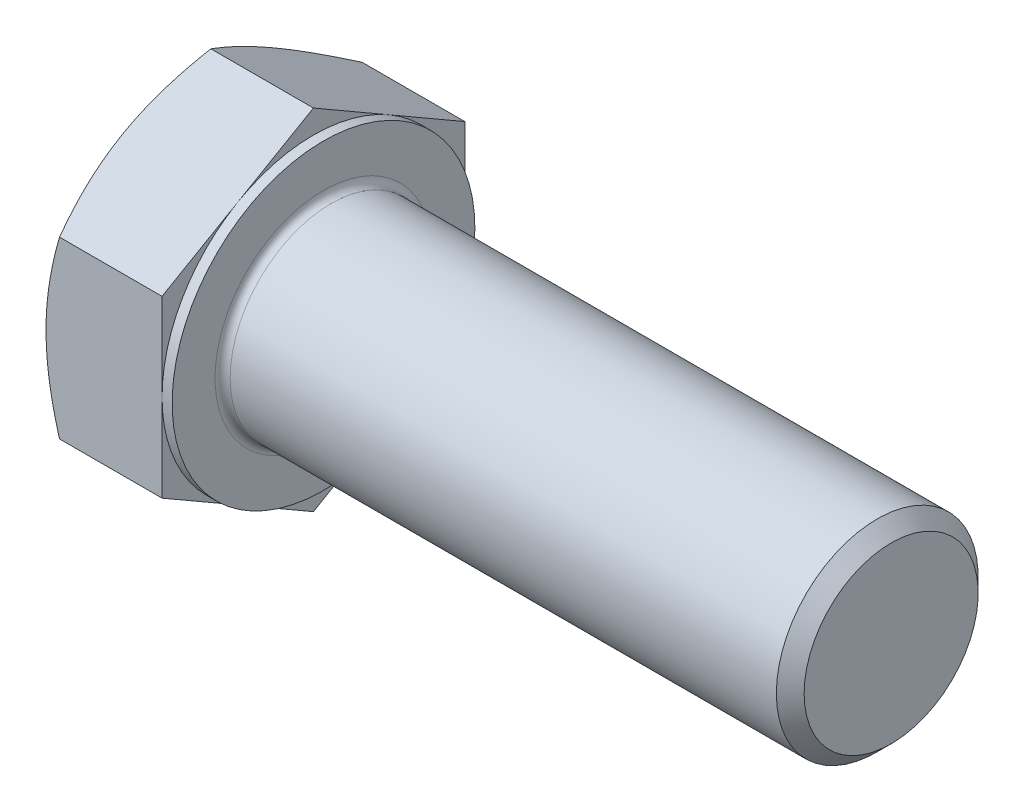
ISO-10303-21;
HEADER;
FILE_DESCRIPTION(('STEP AP214'),'2;1');
FILE_NAME('part.step','',(''),(''),'','','');
FILE_SCHEMA(('AUTOMOTIVE_DESIGN { 1 0 10303 214 1 1 1 1 }'));
ENDSEC;
DATA;
#1=APPLICATION_CONTEXT('core data for automotive mechanical design processes');
#2=APPLICATION_PROTOCOL_DEFINITION('international standard','automotive_design',2000,#1);
#3=PRODUCT_CONTEXT('',#1,'mechanical');
#4=PRODUCT('Part','Part','',(#3));
#5=PRODUCT_RELATED_PRODUCT_CATEGORY('part','',(#4));
#6=PRODUCT_DEFINITION_FORMATION('','',#4);
#7=PRODUCT_DEFINITION_CONTEXT('part definition',#1,'design');
#8=PRODUCT_DEFINITION('design','',#6,#7);
#9=PRODUCT_DEFINITION_SHAPE('','',#8);
#10=(LENGTH_UNIT() NAMED_UNIT(*) SI_UNIT(.MILLI.,.METRE.));
#11=(NAMED_UNIT(*) PLANE_ANGLE_UNIT() SI_UNIT($,.RADIAN.));
#12=(NAMED_UNIT(*) SI_UNIT($,.STERADIAN.) SOLID_ANGLE_UNIT());
#13=UNCERTAINTY_MEASURE_WITH_UNIT(LENGTH_MEASURE(1.E-05),#10,'distance_accuracy_value','');
#14=(GEOMETRIC_REPRESENTATION_CONTEXT(3) GLOBAL_UNCERTAINTY_ASSIGNED_CONTEXT((#13)) GLOBAL_UNIT_ASSIGNED_CONTEXT((#10,
#11,#12)) REPRESENTATION_CONTEXT('',''));
#15=CARTESIAN_POINT('',(0.,0.,0.));
#16=DIRECTION('',(0.,0.,1.));
#17=DIRECTION('',(1.,0.,0.));
#18=AXIS2_PLACEMENT_3D('',#15,#16,#17);
#19=CARTESIAN_POINT('',(10.,13.856406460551,0.));
#20=DIRECTION('',(1.,0.,0.));
#21=DIRECTION('',(0.,0.,-1.));
#22=AXIS2_PLACEMENT_3D('',#19,#20,#21);
#23=PLANE('',#22);
#24=CARTESIAN_POINT('',(10.,0.,0.));
#25=DIRECTION('',(1.,0.,0.));
#26=DIRECTION('',(0.,0.,-1.));
#27=AXIS2_PLACEMENT_3D('',#24,#25,#26);
#28=CIRCLE('',#27,8.6);
#29=CARTESIAN_POINT('',(10.,0.,-8.6));
#30=VERTEX_POINT('',#29);
#31=EDGE_CURVE('E38',#30,#30,#28,.F.);
#32=ORIENTED_EDGE('',*,*,#31,.T.);
#33=EDGE_LOOP('',(#32));
#34=FACE_BOUND('',#33,.T.);
#35=CARTESIAN_POINT('',(10.,0.,0.));
#36=DIRECTION('',(1.,0.,0.));
#37=DIRECTION('',(0.,0.,-1.));
#38=AXIS2_PLACEMENT_3D('',#35,#36,#37);
#39=CIRCLE('',#38,12.);
#40=CARTESIAN_POINT('',(10.,0.,-12.));
#41=VERTEX_POINT('',#40);
#42=EDGE_CURVE('E289',#41,#41,#39,.T.);
#43=ORIENTED_EDGE('',*,*,#42,.T.);
#44=EDGE_LOOP('',(#43));
#45=FACE_BOUND('',#44,.T.);
#46=ADVANCED_FACE('F30',(#34,#45),#23,.T.);
#47=CARTESIAN_POINT('',(0.,0.,0.));
#48=DIRECTION('',(-1.,0.,0.));
#49=DIRECTION('',(0.,0.,1.));
#50=AXIS2_PLACEMENT_3D('',#47,#48,#49);
#51=CYLINDRICAL_SURFACE('',#50,8.);
#52=CARTESIAN_POINT('',(10.6,0.,0.));
#53=DIRECTION('',(1.,0.,0.));
#54=DIRECTION('',(0.,0.,-1.));
#55=AXIS2_PLACEMENT_3D('',#52,#53,#54);
#56=CIRCLE('',#55,8.);
#57=CARTESIAN_POINT('',(10.6,0.,-8.));
#58=VERTEX_POINT('',#57);
#59=EDGE_CURVE('E11',#58,#58,#56,.T.);
#60=ORIENTED_EDGE('',*,*,#59,.T.);
#61=EDGE_LOOP('',(#60));
#62=FACE_BOUND('',#61,.T.);
#63=CARTESIAN_POINT('',(53.8985,0.,0.));
#64=DIRECTION('',(-1.,0.,0.));
#65=DIRECTION('',(0.,0.,1.));
#66=AXIS2_PLACEMENT_3D('',#63,#64,#65);
#67=CIRCLE('',#66,8.);
#68=CARTESIAN_POINT('',(53.8985,0.,8.));
#69=VERTEX_POINT('',#68);
#70=EDGE_CURVE('E268',#69,#69,#67,.T.);
#71=ORIENTED_EDGE('',*,*,#70,.T.);
#72=EDGE_LOOP('',(#71));
#73=FACE_BOUND('',#72,.T.);
#74=ADVANCED_FACE('F242',(#62,#73),#51,.T.);
#75=CARTESIAN_POINT('',(55.,0.,0.));
#76=DIRECTION('',(-1.,0.,0.));
#77=DIRECTION('',(0.,0.,1.));
#78=AXIS2_PLACEMENT_3D('',#75,#76,#77);
#79=CONICAL_SURFACE('',#78,6.8985,0.78539816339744);
#80=ORIENTED_EDGE('',*,*,#70,.F.);
#81=EDGE_LOOP('',(#80));
#82=FACE_BOUND('',#81,.T.);
#83=CARTESIAN_POINT('',(55.,0.,0.));
#84=DIRECTION('',(-1.,0.,0.));
#85=DIRECTION('',(0.,0.,1.));
#86=AXIS2_PLACEMENT_3D('',#83,#84,#85);
#87=CIRCLE('',#86,6.8985);
#88=CARTESIAN_POINT('',(55.,0.,6.8985));
#89=VERTEX_POINT('',#88);
#90=EDGE_CURVE('E266',#89,#89,#87,.T.);
#91=ORIENTED_EDGE('',*,*,#90,.T.);
#92=EDGE_LOOP('',(#91));
#93=FACE_BOUND('',#92,.T.);
#94=ADVANCED_FACE('F247',(#82,#93),#79,.T.);
#95=CARTESIAN_POINT('',(55.,0.,0.));
#96=DIRECTION('',(-1.,0.,0.));
#97=DIRECTION('',(0.,0.,1.));
#98=AXIS2_PLACEMENT_3D('',#95,#96,#97);
#99=PLANE('',#98);
#100=ORIENTED_EDGE('',*,*,#90,.F.);
#101=EDGE_LOOP('',(#100));
#102=FACE_BOUND('',#101,.T.);
#103=ADVANCED_FACE('F254',(#102),#99,.F.);
#104=CARTESIAN_POINT('',(9.2,12.,0.));
#105=DIRECTION('',(1.,0.,0.));
#106=DIRECTION('',(0.,0.,-1.));
#107=AXIS2_PLACEMENT_3D('',#104,#105,#106);
#108=PLANE('',#107);
#109=DIRECTION('',(0.,0.500000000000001,0.866025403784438));
#110=VECTOR('',#109,1.);
#111=CARTESIAN_POINT('',(9.2,6.9282032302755,-12.));
#112=LINE('',#111,#110);
#113=CARTESIAN_POINT('',(9.2,6.9282032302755,-12.));
#114=VERTEX_POINT('',#113);
#115=CARTESIAN_POINT('',(9.2,10.3923048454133,-6.00000000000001));
#116=VERTEX_POINT('',#115);
#117=EDGE_CURVE('E162',#114,#116,#112,.T.);
#118=ORIENTED_EDGE('',*,*,#117,.T.);
#119=CARTESIAN_POINT('',(9.2,0.,0.));
#120=DIRECTION('',(-1.,0.,0.));
#121=DIRECTION('',(0.,0.,1.));
#122=AXIS2_PLACEMENT_3D('',#119,#120,#121);
#123=CIRCLE('',#122,12.);
#124=CARTESIAN_POINT('',(9.2,0.,-12.));
#125=VERTEX_POINT('',#124);
#126=EDGE_CURVE('E45',#116,#125,#123,.T.);
#127=ORIENTED_EDGE('',*,*,#126,.T.);
#128=DIRECTION('',(0.,1.,0.));
#129=VECTOR('',#128,1.);
#130=CARTESIAN_POINT('',(9.2,6.9282032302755,-12.));
#131=LINE('',#130,#129);
#132=EDGE_CURVE('E292',#125,#114,#131,.T.);
#133=ORIENTED_EDGE('',*,*,#132,.T.);
#134=EDGE_LOOP('',(#118,#127,#133));
#135=FACE_BOUND('',#134,.T.);
#136=ADVANCED_FACE('F257',(#135),#108,.T.);
#137=CARTESIAN_POINT('',(9.2,13.856406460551,0.));
#138=VERTEX_POINT('',#137);
#139=EDGE_CURVE('E160',#116,#138,#112,.T.);
#140=ORIENTED_EDGE('',*,*,#139,.T.);
#141=DIRECTION('',(0.,-0.500000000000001,0.866025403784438));
#142=VECTOR('',#141,1.);
#143=CARTESIAN_POINT('',(9.2,13.856406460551,0.));
#144=LINE('',#143,#142);
#145=CARTESIAN_POINT('',(9.2,10.3923048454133,6.00000000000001));
#146=VERTEX_POINT('',#145);
#147=EDGE_CURVE('E159',#138,#146,#144,.T.);
#148=ORIENTED_EDGE('',*,*,#147,.T.);
#149=EDGE_CURVE('E148',#146,#116,#123,.T.);
#150=ORIENTED_EDGE('',*,*,#149,.T.);
#151=EDGE_LOOP('',(#140,#148,#150));
#152=FACE_BOUND('',#151,.T.);
#153=ADVANCED_FACE('F262',(#152),#108,.T.);
#154=CARTESIAN_POINT('',(9.2,6.9282032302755,12.));
#155=VERTEX_POINT('',#154);
#156=EDGE_CURVE('E127',#146,#155,#144,.T.);
#157=ORIENTED_EDGE('',*,*,#156,.T.);
#158=DIRECTION('',(0.,-1.,0.));
#159=VECTOR('',#158,1.);
#160=CARTESIAN_POINT('',(9.2,6.9282032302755,12.));
#161=LINE('',#160,#159);
#162=CARTESIAN_POINT('',(9.2,0.,12.));
#163=VERTEX_POINT('',#162);
#164=EDGE_CURVE('E121',#155,#163,#161,.T.);
#165=ORIENTED_EDGE('',*,*,#164,.T.);
#166=EDGE_CURVE('E125',#163,#146,#123,.T.);
#167=ORIENTED_EDGE('',*,*,#166,.T.);
#168=EDGE_LOOP('',(#157,#165,#167));
#169=FACE_BOUND('',#168,.T.);
#170=ADVANCED_FACE('F123',(#169),#108,.T.);
#171=CARTESIAN_POINT('',(9.2,-6.92820323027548,12.));
#172=VERTEX_POINT('',#171);
#173=EDGE_CURVE('E131',#163,#172,#161,.T.);
#174=ORIENTED_EDGE('',*,*,#173,.T.);
#175=DIRECTION('',(0.,-0.500000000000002,-0.866025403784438));
#176=VECTOR('',#175,1.);
#177=CARTESIAN_POINT('',(9.2,-13.856406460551,0.));
#178=LINE('',#177,#176);
#179=CARTESIAN_POINT('',(9.2,-10.3923048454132,6.00000000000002));
#180=VERTEX_POINT('',#179);
#181=EDGE_CURVE('E138',#172,#180,#178,.T.);
#182=ORIENTED_EDGE('',*,*,#181,.T.);
#183=EDGE_CURVE('E135',#180,#163,#123,.T.);
#184=ORIENTED_EDGE('',*,*,#183,.T.);
#185=EDGE_LOOP('',(#174,#182,#184));
#186=FACE_BOUND('',#185,.T.);
#187=ADVANCED_FACE('F136',(#186),#108,.T.);
#188=CARTESIAN_POINT('',(9.2,-13.856406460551,0.));
#189=VERTEX_POINT('',#188);
#190=EDGE_CURVE('E154',#180,#189,#178,.T.);
#191=ORIENTED_EDGE('',*,*,#190,.T.);
#192=DIRECTION('',(0.,0.5,-0.866025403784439));
#193=VECTOR('',#192,1.);
#194=CARTESIAN_POINT('',(9.2,-6.92820323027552,-12.));
#195=LINE('',#194,#193);
#196=CARTESIAN_POINT('',(9.2,-10.3923048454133,-6.));
#197=VERTEX_POINT('',#196);
#198=EDGE_CURVE('E330',#189,#197,#195,.T.);
#199=ORIENTED_EDGE('',*,*,#198,.T.);
#200=EDGE_CURVE('E142',#197,#180,#123,.T.);
#201=ORIENTED_EDGE('',*,*,#200,.T.);
#202=EDGE_LOOP('',(#191,#199,#201));
#203=FACE_BOUND('',#202,.T.);
#204=ADVANCED_FACE('F331',(#203),#108,.T.);
#205=CARTESIAN_POINT('',(9.2,-6.92820323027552,-12.));
#206=VERTEX_POINT('',#205);
#207=EDGE_CURVE('E149',#197,#206,#195,.T.);
#208=ORIENTED_EDGE('',*,*,#207,.T.);
#209=EDGE_CURVE('E293',#206,#125,#131,.T.);
#210=ORIENTED_EDGE('',*,*,#209,.T.);
#211=EDGE_CURVE('E300',#125,#197,#123,.T.);
#212=ORIENTED_EDGE('',*,*,#211,.T.);
#213=EDGE_LOOP('',(#208,#210,#212));
#214=FACE_BOUND('',#213,.T.);
#215=ADVANCED_FACE('F263',(#214),#108,.T.);
#216=CARTESIAN_POINT('',(0.,0.,0.));
#217=DIRECTION('',(-1.,0.,0.));
#218=DIRECTION('',(0.,0.,1.));
#219=AXIS2_PLACEMENT_3D('',#216,#217,#218);
#220=CYLINDRICAL_SURFACE('',#219,12.);
#221=ORIENTED_EDGE('',*,*,#126,.F.);
#222=ORIENTED_EDGE('',*,*,#149,.F.);
#223=ORIENTED_EDGE('',*,*,#166,.F.);
#224=ORIENTED_EDGE('',*,*,#183,.F.);
#225=ORIENTED_EDGE('',*,*,#200,.F.);
#226=ORIENTED_EDGE('',*,*,#211,.F.);
#227=EDGE_LOOP('',(#221,#222,#223,#224,#225,#226));
#228=FACE_BOUND('',#227,.T.);
#229=ORIENTED_EDGE('',*,*,#42,.F.);
#230=EDGE_LOOP('',(#229));
#231=FACE_BOUND('',#230,.T.);
#232=ADVANCED_FACE('F145',(#228,#231),#220,.T.);
#233=CARTESIAN_POINT('',(0.,13.856406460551,0.));
#234=DIRECTION('',(1.,0.,0.));
#235=DIRECTION('',(0.,0.,-1.));
#236=AXIS2_PLACEMENT_3D('',#233,#234,#235);
#237=PLANE('',#236);
#238=CARTESIAN_POINT('',(0.,0.,0.));
#239=DIRECTION('',(1.,0.,0.));
#240=DIRECTION('',(0.,0.,-1.));
#241=AXIS2_PLACEMENT_3D('',#238,#239,#240);
#242=CIRCLE('',#241,12.);
#243=CARTESIAN_POINT('',(0.,0.,-12.));
#244=VERTEX_POINT('',#243);
#245=CARTESIAN_POINT('',(0.,10.3923048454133,-6.00000000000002));
#246=VERTEX_POINT('',#245);
#247=EDGE_CURVE('E288',#244,#246,#242,.T.);
#248=ORIENTED_EDGE('',*,*,#247,.F.);
#249=CARTESIAN_POINT('',(0.,-10.3923048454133,-6.));
#250=VERTEX_POINT('',#249);
#251=EDGE_CURVE('E284',#250,#244,#242,.T.);
#252=ORIENTED_EDGE('',*,*,#251,.F.);
#253=CARTESIAN_POINT('',(0.,-10.3923048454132,6.00000000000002));
#254=VERTEX_POINT('',#253);
#255=EDGE_CURVE('E287',#254,#250,#242,.T.);
#256=ORIENTED_EDGE('',*,*,#255,.F.);
#257=CARTESIAN_POINT('',(0.,0.,12.));
#258=VERTEX_POINT('',#257);
#259=EDGE_CURVE('E323',#258,#254,#242,.T.);
#260=ORIENTED_EDGE('',*,*,#259,.F.);
#261=CARTESIAN_POINT('',(0.,0.,0.));
#262=DIRECTION('',(-1.,0.,0.));
#263=DIRECTION('',(0.,0.,1.));
#264=AXIS2_PLACEMENT_3D('',#261,#262,#263);
#265=CIRCLE('',#264,12.);
#266=CARTESIAN_POINT('',(0.,10.3923048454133,6.00000000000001));
#267=VERTEX_POINT('',#266);
#268=EDGE_CURVE('E163',#258,#267,#265,.T.);
#269=ORIENTED_EDGE('',*,*,#268,.T.);
#270=EDGE_CURVE('E346',#246,#267,#242,.T.);
#271=ORIENTED_EDGE('',*,*,#270,.F.);
#272=EDGE_LOOP('',(#248,#252,#256,#260,#269,#271));
#273=FACE_BOUND('',#272,.T.);
#274=ADVANCED_FACE('F192',(#273),#237,.F.);
#275=CARTESIAN_POINT('',(0.,0.,0.));
#276=DIRECTION('',(1.,0.,0.));
#277=DIRECTION('',(0.,0.,-1.));
#278=AXIS2_PLACEMENT_3D('',#275,#276,#277);
#279=CONICAL_SURFACE('',#278,12.,1.0471975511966);
#280=CARTESIAN_POINT('',(1.07186343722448,6.92808776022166,12.0002));
#281=CARTESIAN_POINT('',(0.983949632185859,7.08038456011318,11.7364142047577));
#282=CARTESIAN_POINT('',(0.900025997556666,7.2332492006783,11.4716448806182));
#283=CARTESIAN_POINT('',(0.74126621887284,7.54020434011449,10.9399829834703));
#284=CARTESIAN_POINT('',(0.666433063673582,7.69429522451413,10.6730897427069));
#285=CARTESIAN_POINT('',(0.45701753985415,8.15905073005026,9.86810959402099));
#286=CARTESIAN_POINT('',(0.337903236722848,8.47155003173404,9.3268449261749));
#287=CARTESIAN_POINT('',(0.198231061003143,8.93919090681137,8.51686717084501));
#288=CARTESIAN_POINT('',(0.158443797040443,9.09293539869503,8.25057389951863));
#289=CARTESIAN_POINT('',(0.0917233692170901,9.40113622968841,7.71675440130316));
#290=CARTESIAN_POINT('',(0.0647904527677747,9.55559258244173,7.44922815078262));
#291=CARTESIAN_POINT('',(0.0244685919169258,9.86476279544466,6.91372963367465));
#292=CARTESIAN_POINT('',(0.0110635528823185,10.0194761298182,6.64575827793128));
#293=CARTESIAN_POINT('',(-0.00191690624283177,10.3290461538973,6.10956726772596));
#294=CARTESIAN_POINT('',(-0.00149275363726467,10.4839028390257,5.84134762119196));
#295=CARTESIAN_POINT('',(0.0122200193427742,10.7734076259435,5.3399106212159));
#296=CARTESIAN_POINT('',(0.023835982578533,10.908076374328,5.10665750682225));
#297=CARTESIAN_POINT('',(0.0573080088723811,11.1771041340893,4.64068775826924));
#298=CARTESIAN_POINT('',(0.0791647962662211,11.3114631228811,4.40797116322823));
#299=CARTESIAN_POINT('',(0.132737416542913,11.5797983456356,3.94320092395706));
#300=CARTESIAN_POINT('',(0.164461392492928,11.7137741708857,3.711147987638));
#301=CARTESIAN_POINT('',(0.237211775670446,11.9810977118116,3.24813003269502));
#302=CARTESIAN_POINT('',(0.278238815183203,12.1144453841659,3.01716508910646));
#303=CARTESIAN_POINT('',(0.416311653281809,12.5192297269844,2.31605804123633));
#304=CARTESIAN_POINT('',(0.527124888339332,12.789494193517,1.84794625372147));
#305=CARTESIAN_POINT('',(0.77862576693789,13.3259930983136,0.918702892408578));
#306=CARTESIAN_POINT('',(0.91925434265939,13.5922344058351,0.457559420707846));
#307=CARTESIAN_POINT('',(1.07186343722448,13.8565219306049,-0.000200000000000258));
#308=B_SPLINE_CURVE_WITH_KNOTS('',3,(#280,#281,#282,#283,#284,#285,#286,#287,#288,#289,#290,
#291,#292,#293,#294,#295,#296,#297,#298,#299,#300,#301,#302,#303,#304,#305,#306,#307),
.UNSPECIFIED.,.F.,.F.,(4,2,2,2,2,2,2,2,2,2,2,2,2,4),(0.,0.951004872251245,1.90232158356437,
3.80900466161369,4.7389455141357,5.66890426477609,6.59775529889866,7.5265776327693,
8.33514643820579,9.1437724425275,9.95306755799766,10.7624176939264,12.4167102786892,
14.0677556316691),.UNSPECIFIED.);
#309=CARTESIAN_POINT('',(1.07179676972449,13.856406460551,0.));
#310=VERTEX_POINT('',#309);
#311=EDGE_CURVE('E211',#267,#310,#308,.T.);
#312=ORIENTED_EDGE('',*,*,#311,.T.);
#313=CARTESIAN_POINT('',(1.07186343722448,13.8565219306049,0.000199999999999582));
#314=CARTESIAN_POINT('',(0.983949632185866,13.7042251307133,-0.263585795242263));
#315=CARTESIAN_POINT('',(0.900025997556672,13.5513604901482,-0.528355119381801));
#316=CARTESIAN_POINT('',(0.741266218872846,13.244405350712,-1.06001701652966));
#317=CARTESIAN_POINT('',(0.666433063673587,13.0903144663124,-1.32691025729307));
#318=CARTESIAN_POINT('',(0.457017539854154,12.6255589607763,-2.13189040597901));
#319=CARTESIAN_POINT('',(0.337903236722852,12.3130596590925,-2.6731550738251));
#320=CARTESIAN_POINT('',(0.198231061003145,11.8454187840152,-3.483132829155));
#321=CARTESIAN_POINT('',(0.158443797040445,11.6916742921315,-3.74942610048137));
#322=CARTESIAN_POINT('',(0.0917233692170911,11.3834734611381,-4.28324559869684));
#323=CARTESIAN_POINT('',(0.0647904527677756,11.2290171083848,-4.55077184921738));
#324=CARTESIAN_POINT('',(0.0244685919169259,10.9198468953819,-5.08627036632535));
#325=CARTESIAN_POINT('',(0.0110635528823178,10.7651335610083,-5.35424172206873));
#326=CARTESIAN_POINT('',(-0.00191690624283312,10.4555635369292,-5.89043273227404));
#327=CARTESIAN_POINT('',(-0.00149275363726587,10.3007068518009,-6.15865237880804));
#328=CARTESIAN_POINT('',(0.0122200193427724,10.011202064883,-6.66008937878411));
#329=CARTESIAN_POINT('',(0.0238359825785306,9.87653331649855,-6.89334249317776));
#330=CARTESIAN_POINT('',(0.0573080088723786,9.60750555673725,-7.35931224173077));
#331=CARTESIAN_POINT('',(0.079164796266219,9.47314656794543,-7.59202883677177));
#332=CARTESIAN_POINT('',(0.132737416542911,9.20481134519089,-8.05679907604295));
#333=CARTESIAN_POINT('',(0.164461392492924,9.07083551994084,-8.28885201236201));
#334=CARTESIAN_POINT('',(0.237211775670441,8.80351197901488,-8.75186996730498));
#335=CARTESIAN_POINT('',(0.278238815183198,8.67016430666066,-8.98283491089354));
#336=CARTESIAN_POINT('',(0.416311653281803,8.2653799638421,-9.68394195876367));
#337=CARTESIAN_POINT('',(0.527124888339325,7.99511549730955,-10.1520537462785));
#338=CARTESIAN_POINT('',(0.778625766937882,7.45861659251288,-11.0812971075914));
#339=CARTESIAN_POINT('',(0.919254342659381,7.19237528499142,-11.5424405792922));
#340=CARTESIAN_POINT('',(1.07186343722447,6.92808776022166,-12.0002));
#341=B_SPLINE_CURVE_WITH_KNOTS('',3,(#313,#314,#315,#316,#317,#318,#319,#320,#321,#322,#323,
#324,#325,#326,#327,#328,#329,#330,#331,#332,#333,#334,#335,#336,#337,#338,#339,#340),
.UNSPECIFIED.,.F.,.F.,(4,2,2,2,2,2,2,2,2,2,2,2,2,4),(0.,0.951004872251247,1.90232158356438,
3.80900466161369,4.73894551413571,5.6689042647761,6.59775529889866,7.52657763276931,
8.3351464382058,9.1437724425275,9.95306755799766,10.7624176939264,12.4167102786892,
14.0677556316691),.UNSPECIFIED.);
#342=EDGE_CURVE('E53',#310,#246,#341,.T.);
#343=ORIENTED_EDGE('',*,*,#342,.T.);
#344=ORIENTED_EDGE('',*,*,#270,.T.);
#345=EDGE_LOOP('',(#312,#343,#344));
#346=FACE_BOUND('',#345,.T.);
#347=ADVANCED_FACE('F347',(#346),#279,.T.);
#348=CARTESIAN_POINT('',(5.93796522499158,-18.7780422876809,12.));
#349=CARTESIAN_POINT('',(5.81013580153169,-18.5152821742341,12.));
#350=CARTESIAN_POINT('',(5.68293119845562,-18.2522182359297,12.));
#351=CARTESIAN_POINT('',(5.42991281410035,-17.7254193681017,12.));
#352=CARTESIAN_POINT('',(5.30409904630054,-17.4616844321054,12.));
#353=CARTESIAN_POINT('',(4.92892368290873,-16.6693101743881,12.));
#354=CARTESIAN_POINT('',(4.68186469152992,-16.1395765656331,12.));
#355=CARTESIAN_POINT('',(4.1940547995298,-15.0738169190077,12.));
#356=CARTESIAN_POINT('',(3.95334413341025,-14.5377724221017,12.));
#357=CARTESIAN_POINT('',(3.48154718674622,-13.461479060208,12.));
#358=CARTESIAN_POINT('',(3.25046046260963,-12.9212303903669,12.));
#359=CARTESIAN_POINT('',(2.79294900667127,-11.8175688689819,12.));
#360=CARTESIAN_POINT('',(2.566936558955,-11.2539842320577,12.));
#361=CARTESIAN_POINT('',(2.13161283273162,-10.1202797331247,12.));
#362=CARTESIAN_POINT('',(1.9223034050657,-9.55015915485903,12.));
#363=CARTESIAN_POINT('',(1.52576124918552,-8.40350794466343,12.));
#364=CARTESIAN_POINT('',(1.33848523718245,-7.82699240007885,12.));
#365=CARTESIAN_POINT('',(0.991896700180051,-6.66563869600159,12.));
#366=CARTESIAN_POINT('',(0.832575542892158,-6.08080316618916,12.));
#367=CARTESIAN_POINT('',(0.620681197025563,-5.19882791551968,12.));
#368=CARTESIAN_POINT('',(0.554713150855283,-4.90488790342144,12.));
#369=CARTESIAN_POINT('',(0.432574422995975,-4.31496880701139,12.));
#370=CARTESIAN_POINT('',(0.376403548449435,-4.01898976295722,12.));
#371=CARTESIAN_POINT('',(0.274840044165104,-3.42518449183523,12.));
#372=CARTESIAN_POINT('',(0.229447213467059,-3.12735829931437,12.));
#373=CARTESIAN_POINT('',(0.150338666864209,-2.53016033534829,12.));
#374=CARTESIAN_POINT('',(0.116622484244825,-2.23078862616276,12.));
#375=CARTESIAN_POINT('',(0.0619693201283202,-1.63489952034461,12.));
#376=CARTESIAN_POINT('',(0.0408679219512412,-1.33839729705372,12.));
#377=CARTESIAN_POINT('',(0.011231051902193,-0.744766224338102,12.));
#378=CARTESIAN_POINT('',(0.00269536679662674,-0.447637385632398,12.));
#379=CARTESIAN_POINT('',(-0.00160621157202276,0.146715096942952,12.));
#380=CARTESIAN_POINT('',(0.00262788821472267,0.443938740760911,12.));
#381=CARTESIAN_POINT('',(0.0237602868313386,1.03793867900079,12.));
#382=CARTESIAN_POINT('',(0.0406591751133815,1.33471495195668,12.));
#383=CARTESIAN_POINT('',(0.0957363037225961,2.04293812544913,12.));
#384=CARTESIAN_POINT('',(0.139644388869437,2.45394931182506,12.));
#385=CARTESIAN_POINT('',(0.249393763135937,3.27301119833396,12.));
#386=CARTESIAN_POINT('',(0.315237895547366,3.6810615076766,12.));
#387=CARTESIAN_POINT('',(0.542190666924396,4.90025554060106,12.));
#388=CARTESIAN_POINT('',(0.73268127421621,5.70600726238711,12.));
#389=CARTESIAN_POINT('',(1.06415793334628,6.91101760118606,12.));
#390=CARTESIAN_POINT('',(1.18384338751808,7.31649624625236,12.));
#391=CARTESIAN_POINT('',(1.43593551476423,8.12351840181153,12.));
#392=CARTESIAN_POINT('',(1.56834227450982,8.52506188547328,12.));
#393=CARTESIAN_POINT('',(1.84372865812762,9.32433402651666,12.));
#394=CARTESIAN_POINT('',(1.98670500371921,9.72206382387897,12.));
#395=CARTESIAN_POINT('',(2.28151949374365,10.5142091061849,12.));
#396=CARTESIAN_POINT('',(2.43335751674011,10.9086246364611,12.));
#397=CARTESIAN_POINT('',(2.81137815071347,11.8636440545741,12.));
#398=CARTESIAN_POINT('',(3.04143185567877,12.4227131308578,12.));
#399=CARTESIAN_POINT('',(3.51333410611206,13.5358669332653,12.));
#400=CARTESIAN_POINT('',(3.75518348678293,14.0899513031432,12.));
#401=CARTESIAN_POINT('',(4.24823475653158,15.1941025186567,12.));
#402=CARTESIAN_POINT('',(4.49943904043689,15.7441682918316,12.));
#403=CARTESIAN_POINT('',(5.00924552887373,16.8408349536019,12.));
#404=CARTESIAN_POINT('',(5.26784754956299,17.38743592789,12.));
#405=CARTESIAN_POINT('',(5.79133879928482,18.4784293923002,12.));
#406=CARTESIAN_POINT('',(6.05623527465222,19.0228183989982,12.));
#407=CARTESIAN_POINT('',(6.59090796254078,20.1091945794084,12.));
#408=CARTESIAN_POINT('',(6.86068419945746,20.6511817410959,12.));
#409=CARTESIAN_POINT('',(7.40421496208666,21.7330545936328,12.));
#410=CARTESIAN_POINT('',(7.677968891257,22.2729405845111,12.));
#411=CARTESIAN_POINT('',(8.22882461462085,23.3510028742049,12.));
#412=CARTESIAN_POINT('',(8.50592642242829,23.8891791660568,12.));
#413=CARTESIAN_POINT('',(9.29226596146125,25.4066579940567,12.));
#414=CARTESIAN_POINT('',(9.80475659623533,26.3842748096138,12.));
#415=CARTESIAN_POINT('',(10.8366490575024,28.3358962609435,12.));
#416=CARTESIAN_POINT('',(11.3560511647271,29.3099007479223,12.));
#417=CARTESIAN_POINT('',(12.3986980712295,31.2524398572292,12.));
#418=CARTESIAN_POINT('',(12.9219285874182,32.2209821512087,12.));
#419=CARTESIAN_POINT('',(13.709817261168,33.6721037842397,12.));
#420=CARTESIAN_POINT('',(13.9729461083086,34.1555146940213,12.));
#421=CARTESIAN_POINT('',(14.5001155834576,35.1218381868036,12.));
#422=CARTESIAN_POINT('',(14.7641562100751,35.6047507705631,12.));
#423=CARTESIAN_POINT('',(15.0285993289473,36.0874429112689,12.));
#424=B_SPLINE_CURVE_WITH_KNOTS('',3,(#348,#349,#350,#351,#352,#353,#354,#355,#356,#357,#358,
#359,#360,#361,#362,#363,#364,#365,#366,#367,#368,#369,#370,#371,#372,#373,#374,#375,#376,#377,
#378,#379,#380,#381,#382,#383,#384,#385,#386,#387,#388,#389,#390,#391,#392,#393,#394,#395,#396,
#397,#398,#399,#400,#401,#402,#403,#404,#405,#406,#407,#408,#409,#410,#411,#412,#413,#414,#415,
#416,#417,#418,#419,#420,#421,#422,#423),.UNSPECIFIED.,.F.,.F.,(4,2,2,2,2,2,2,2,2,2,2,2,2,2,2,2,
2,2,2,2,2,2,2,2,2,2,2,2,2,2,2,2,2,2,2,2,2,4),(0.,0.876610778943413,1.75323004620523,
3.50671945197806,5.26947518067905,7.03214956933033,8.85359042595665,10.6752328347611,
12.4932347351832,14.3106742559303,15.2142921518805,16.117892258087,17.0214755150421,
17.9250226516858,18.816520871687,19.7080039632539,20.5994865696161,21.4910106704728,
22.7303633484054,23.9698767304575,26.4502079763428,27.7184187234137,28.9866381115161,
30.2544657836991,31.5222760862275,33.3357454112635,35.1493433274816,36.9634087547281,
38.7774291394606,40.5936500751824,42.4098800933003,44.2258404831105,46.0418082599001,
49.3531754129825,52.6646774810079,55.9671781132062,57.6183303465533,59.2694800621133),.UNSPECIFIED.);
#425=CARTESIAN_POINT('',(1.07179676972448,6.9282032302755,12.));
#426=VERTEX_POINT('',#425);
#427=EDGE_CURVE('E223',#258,#426,#424,.T.);
#428=ORIENTED_EDGE('',*,*,#427,.T.);
#429=EDGE_CURVE('E222',#426,#267,#308,.T.);
#430=ORIENTED_EDGE('',*,*,#429,.T.);
#431=ORIENTED_EDGE('',*,*,#268,.F.);
#432=EDGE_LOOP('',(#428,#430,#431));
#433=FACE_BOUND('',#432,.T.);
#434=ADVANCED_FACE('F317',(#433),#279,.T.);
#435=CARTESIAN_POINT('',(1.07179676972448,-6.92820323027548,12.));
#436=VERTEX_POINT('',#435);
#437=EDGE_CURVE('E269',#436,#258,#424,.T.);
#438=ORIENTED_EDGE('',*,*,#437,.T.);
#439=ORIENTED_EDGE('',*,*,#259,.T.);
#440=CARTESIAN_POINT('',(1.07186343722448,-13.8565219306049,-0.000200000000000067));
#441=CARTESIAN_POINT('',(0.983949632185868,-13.7042251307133,0.263585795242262));
#442=CARTESIAN_POINT('',(0.900025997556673,-13.5513604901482,0.5283551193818));
#443=CARTESIAN_POINT('',(0.741266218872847,-13.244405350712,1.06001701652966));
#444=CARTESIAN_POINT('',(0.666433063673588,-13.0903144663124,1.32691025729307));
#445=CARTESIAN_POINT('',(0.457017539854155,-12.6255589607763,2.13189040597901));
#446=CARTESIAN_POINT('',(0.337903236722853,-12.3130596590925,2.6731550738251));
#447=CARTESIAN_POINT('',(0.198231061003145,-11.8454187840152,3.48313282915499));
#448=CARTESIAN_POINT('',(0.158443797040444,-11.6916742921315,3.74942610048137));
#449=CARTESIAN_POINT('',(0.0917233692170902,-11.3834734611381,4.28324559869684));
#450=CARTESIAN_POINT('',(0.0647904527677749,-11.2290171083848,4.55077184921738));
#451=CARTESIAN_POINT('',(0.0244685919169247,-10.9198468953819,5.08627036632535));
#452=CARTESIAN_POINT('',(0.011063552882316,-10.7651335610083,5.35424172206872));
#453=CARTESIAN_POINT('',(-0.00191690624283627,-10.4555635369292,5.89043273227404));
#454=CARTESIAN_POINT('',(-0.00149275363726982,-10.3007068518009,6.15865237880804));
#455=CARTESIAN_POINT('',(0.0122200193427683,-10.011202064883,6.6600893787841));
#456=CARTESIAN_POINT('',(0.0238359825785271,-9.87653331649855,6.89334249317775));
#457=CARTESIAN_POINT('',(0.057308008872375,-9.60750555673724,7.35931224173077));
#458=CARTESIAN_POINT('',(0.079164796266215,-9.47314656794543,7.59202883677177));
#459=CARTESIAN_POINT('',(0.132737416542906,-9.20481134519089,8.05679907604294));
#460=CARTESIAN_POINT('',(0.164461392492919,-9.07083551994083,8.288852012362));
#461=CARTESIAN_POINT('',(0.237211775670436,-8.80351197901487,8.75186996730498));
#462=CARTESIAN_POINT('',(0.278238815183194,-8.67016430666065,8.98283491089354));
#463=CARTESIAN_POINT('',(0.416311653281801,-8.26537996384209,9.68394195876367));
#464=CARTESIAN_POINT('',(0.527124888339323,-7.99511549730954,10.1520537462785));
#465=CARTESIAN_POINT('',(0.778625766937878,-7.45861659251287,11.0812971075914));
#466=CARTESIAN_POINT('',(0.919254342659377,-7.19237528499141,11.5424405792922));
#467=CARTESIAN_POINT('',(1.07186343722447,-6.92808776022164,12.0002));
#468=B_SPLINE_CURVE_WITH_KNOTS('',3,(#440,#441,#442,#443,#444,#445,#446,#447,#448,#449,#450,
#451,#452,#453,#454,#455,#456,#457,#458,#459,#460,#461,#462,#463,#464,#465,#466,#467),
.UNSPECIFIED.,.F.,.F.,(4,2,2,2,2,2,2,2,2,2,2,2,2,4),(0.,0.951004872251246,1.90232158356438,
3.80900466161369,4.73894551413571,5.6689042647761,6.59775529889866,7.52657763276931,
8.3351464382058,9.1437724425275,9.95306755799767,10.7624176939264,12.4167102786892,
14.0677556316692),.UNSPECIFIED.);
#469=EDGE_CURVE('E213',#254,#436,#468,.T.);
#470=ORIENTED_EDGE('',*,*,#469,.T.);
#471=EDGE_LOOP('',(#438,#439,#470));
#472=FACE_BOUND('',#471,.T.);
#473=ADVANCED_FACE('F181',(#472),#279,.T.);
#474=CARTESIAN_POINT('',(1.07179676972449,-13.856406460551,0.));
#475=VERTEX_POINT('',#474);
#476=EDGE_CURVE('E206',#475,#254,#468,.T.);
#477=ORIENTED_EDGE('',*,*,#476,.T.);
#478=ORIENTED_EDGE('',*,*,#255,.T.);
#479=CARTESIAN_POINT('',(1.07186343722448,-6.92808776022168,-12.0002));
#480=CARTESIAN_POINT('',(0.983949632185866,-7.0803845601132,-11.7364142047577));
#481=CARTESIAN_POINT('',(0.900025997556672,-7.23324920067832,-11.4716448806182));
#482=CARTESIAN_POINT('',(0.741266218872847,-7.54020434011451,-10.9399829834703));
#483=CARTESIAN_POINT('',(0.666433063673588,-7.69429522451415,-10.6730897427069));
#484=CARTESIAN_POINT('',(0.457017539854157,-8.15905073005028,-9.86810959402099));
#485=CARTESIAN_POINT('',(0.337903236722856,-8.47155003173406,-9.3268449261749));
#486=CARTESIAN_POINT('',(0.198231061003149,-8.93919090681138,-8.516867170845));
#487=CARTESIAN_POINT('',(0.15844379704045,-9.09293539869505,-8.25057389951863));
#488=CARTESIAN_POINT('',(0.0917233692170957,-9.40113622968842,-7.71675440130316));
#489=CARTESIAN_POINT('',(0.0647904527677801,-9.55559258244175,-7.44922815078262));
#490=CARTESIAN_POINT('',(0.0244685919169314,-9.86476279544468,-6.91372963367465));
#491=CARTESIAN_POINT('',(0.0110635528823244,-10.0194761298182,-6.64575827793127));
#492=CARTESIAN_POINT('',(-0.00191690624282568,-10.3290461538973,-6.10956726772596));
#493=CARTESIAN_POINT('',(-0.00149275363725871,-10.4839028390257,-5.84134762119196));
#494=CARTESIAN_POINT('',(0.0122200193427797,-10.7734076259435,-5.33991062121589));
#495=CARTESIAN_POINT('',(0.0238359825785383,-10.908076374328,-5.10665750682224));
#496=CARTESIAN_POINT('',(0.0573080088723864,-11.1771041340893,-4.64068775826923));
#497=CARTESIAN_POINT('',(0.0791647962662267,-11.3114631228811,-4.40797116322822));
#498=CARTESIAN_POINT('',(0.132737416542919,-11.5797983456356,-3.94320092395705));
#499=CARTESIAN_POINT('',(0.164461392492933,-11.7137741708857,-3.71114798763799));
#500=CARTESIAN_POINT('',(0.237211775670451,-11.9810977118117,-3.24813003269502));
#501=CARTESIAN_POINT('',(0.278238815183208,-12.1144453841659,-3.01716508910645));
#502=CARTESIAN_POINT('',(0.416311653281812,-12.5192297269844,-2.31605804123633));
#503=CARTESIAN_POINT('',(0.527124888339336,-12.789494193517,-1.84794625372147));
#504=CARTESIAN_POINT('',(0.778625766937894,-13.3259930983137,-0.918702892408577));
#505=CARTESIAN_POINT('',(0.919254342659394,-13.5922344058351,-0.457559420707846));
#506=CARTESIAN_POINT('',(1.07186343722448,-13.8565219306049,0.000199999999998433));
#507=B_SPLINE_CURVE_WITH_KNOTS('',3,(#479,#480,#481,#482,#483,#484,#485,#486,#487,#488,#489,
#490,#491,#492,#493,#494,#495,#496,#497,#498,#499,#500,#501,#502,#503,#504,#505,#506),
.UNSPECIFIED.,.F.,.F.,(4,2,2,2,2,2,2,2,2,2,2,2,2,4),(0.,0.951004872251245,1.90232158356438,
3.80900466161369,4.73894551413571,5.6689042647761,6.59775529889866,7.52657763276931,
8.33514643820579,9.1437724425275,9.95306755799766,10.7624176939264,12.4167102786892,
14.0677556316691),.UNSPECIFIED.);
#508=EDGE_CURVE('E212',#250,#475,#507,.T.);
#509=ORIENTED_EDGE('',*,*,#508,.T.);
#510=EDGE_LOOP('',(#477,#478,#509));
#511=FACE_BOUND('',#510,.T.);
#512=ADVANCED_FACE('F345',(#511),#279,.T.);
#513=CARTESIAN_POINT('',(1.07179676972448,6.9282032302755,-12.));
#514=VERTEX_POINT('',#513);
#515=EDGE_CURVE('E214',#246,#514,#341,.T.);
#516=ORIENTED_EDGE('',*,*,#515,.T.);
#517=CARTESIAN_POINT('',(5.93796522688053,-18.7780422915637,-12.));
#518=CARTESIAN_POINT('',(5.81013580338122,-18.5152821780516,-12.));
#519=CARTESIAN_POINT('',(5.68293120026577,-18.2522182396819,-12.));
#520=CARTESIAN_POINT('',(5.42991281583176,-17.7254193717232,-12.));
#521=CARTESIAN_POINT('',(5.30409904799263,-17.4616844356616,-12.));
#522=CARTESIAN_POINT('',(4.92892368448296,-16.669310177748,-12.));
#523=CARTESIAN_POINT('',(4.68186469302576,-16.139576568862,-12.));
#524=CARTESIAN_POINT('',(4.1940548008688,-15.0738169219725,-12.));
#525=CARTESIAN_POINT('',(3.95334413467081,-14.5377724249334,-12.));
#526=CARTESIAN_POINT('',(3.48154718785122,-13.4614790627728,-12.));
#527=CARTESIAN_POINT('',(3.25046046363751,-12.9212303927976,-12.));
#528=CARTESIAN_POINT('',(2.79294900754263,-11.8175688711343,-12.));
#529=CARTESIAN_POINT('',(2.56693655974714,-11.2539842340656,-12.));
#530=CARTESIAN_POINT('',(2.13161283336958,-10.1202797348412,-12.));
#531=CARTESIAN_POINT('',(1.92230340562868,-9.55015915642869,-12.));
#532=CARTESIAN_POINT('',(1.52576124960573,-8.40350794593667,-12.));
#533=CARTESIAN_POINT('',(1.33848523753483,-7.82699240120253,-12.));
#534=CARTESIAN_POINT('',(0.991896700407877,-6.66563869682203,-12.));
#535=CARTESIAN_POINT('',(0.832575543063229,-6.08080316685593,-12.));
#536=CARTESIAN_POINT('',(0.620681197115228,-5.19882791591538,-12.));
#537=CARTESIAN_POINT('',(0.554713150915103,-4.90488790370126,-12.));
#538=CARTESIAN_POINT('',(0.432574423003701,-4.3149688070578,-12.));
#539=CARTESIAN_POINT('',(0.376403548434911,-4.01898976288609,-12.));
#540=CARTESIAN_POINT('',(0.27484004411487,-3.42518449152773,-12.));
#541=CARTESIAN_POINT('',(0.229447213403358,-3.12735829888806,-12.));
#542=CARTESIAN_POINT('',(0.150338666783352,-2.53016033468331,-12.));
#543=CARTESIAN_POINT('',(0.116622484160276,-2.23078862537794,-12.));
#544=CARTESIAN_POINT('',(0.0619693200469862,-1.63489951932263,-12.));
#545=CARTESIAN_POINT('',(0.0408679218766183,-1.33839729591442,-12.));
#546=CARTESIAN_POINT('',(0.0112310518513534,-0.744766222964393,-12.));
#547=CARTESIAN_POINT('',(0.00269536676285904,-0.447637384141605,-12.));
#548=CARTESIAN_POINT('',(-0.00160621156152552,0.146715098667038,-12.));
#549=CARTESIAN_POINT('',(0.00262788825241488,0.443938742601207,-12.));
#550=CARTESIAN_POINT('',(0.0237602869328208,1.03793868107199,-12.));
#551=CARTESIAN_POINT('',(0.0406591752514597,1.33471495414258,-12.));
#552=CARTESIAN_POINT('',(0.0957363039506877,2.04293812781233,-12.));
#553=CARTESIAN_POINT('',(0.139644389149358,2.45394931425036,-12.));
#554=CARTESIAN_POINT('',(0.249393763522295,3.27301120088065,-12.));
#555=CARTESIAN_POINT('',(0.31523789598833,3.68106151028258,-12.));
#556=CARTESIAN_POINT('',(0.542190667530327,4.90025554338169,-12.));
#557=CARTESIAN_POINT('',(0.732681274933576,5.70600726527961,-12.));
#558=CARTESIAN_POINT('',(1.06415793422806,6.91101760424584,-12.));
#559=CARTESIAN_POINT('',(1.18384338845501,7.31649624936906,-12.));
#560=CARTESIAN_POINT('',(1.43593551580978,8.1235184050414,-12.));
#561=CARTESIAN_POINT('',(1.56834227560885,8.52506188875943,-12.));
#562=CARTESIAN_POINT('',(1.84372865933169,9.32433402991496,-12.));
#563=CARTESIAN_POINT('',(1.98670500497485,9.72206382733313,-12.));
#564=CARTESIAN_POINT('',(2.28151949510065,10.5142091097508,-12.));
#565=CARTESIAN_POINT('',(2.43335751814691,10.9086246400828,-12.));
#566=CARTESIAN_POINT('',(2.81137815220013,11.8636440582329,-12.));
#567=CARTESIAN_POINT('',(3.04143185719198,12.4227131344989,-12.));
#568=CARTESIAN_POINT('',(3.51333410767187,13.5358669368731,-12.));
#569=CARTESIAN_POINT('',(3.7551834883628,14.0899513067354,-12.));
#570=CARTESIAN_POINT('',(4.24823475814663,15.1941025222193,-12.));
#571=CARTESIAN_POINT('',(4.49943904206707,15.7441682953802,-12.));
#572=CARTESIAN_POINT('',(5.00924553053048,16.840834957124,-12.));
#573=CARTESIAN_POINT('',(5.26784755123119,17.3874359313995,-12.));
#574=CARTESIAN_POINT('',(5.79133880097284,18.4784293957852,-12.));
#575=CARTESIAN_POINT('',(6.05623527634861,19.0228184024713,-12.));
#576=CARTESIAN_POINT('',(6.59090796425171,20.1091945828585,-12.));
#577=CARTESIAN_POINT('',(6.86068420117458,20.651181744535,-12.));
#578=CARTESIAN_POINT('',(7.4042149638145,21.7330545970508,-12.));
#579=CARTESIAN_POINT('',(7.67796889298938,22.2729405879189,-12.));
#580=CARTESIAN_POINT('',(8.22882461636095,23.351002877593,-12.));
#581=CARTESIAN_POINT('',(8.5059264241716,23.8891791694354,-12.));
#582=CARTESIAN_POINT('',(9.29226596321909,25.4066579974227,-12.));
#583=CARTESIAN_POINT('',(9.80475659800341,26.3842748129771,-12.));
#584=CARTESIAN_POINT('',(10.8366490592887,28.3358962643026,-12.));
#585=CARTESIAN_POINT('',(11.3560511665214,29.3099007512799,-12.));
#586=CARTESIAN_POINT('',(12.3986980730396,31.2524398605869,-12.));
#587=CARTESIAN_POINT('',(12.921928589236,32.2209821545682,-12.));
#588=CARTESIAN_POINT('',(13.7098172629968,33.6721037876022,-12.));
#589=CARTESIAN_POINT('',(13.9729461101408,34.1555146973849,-12.));
#590=CARTESIAN_POINT('',(14.5001155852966,35.1218381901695,-12.));
#591=CARTESIAN_POINT('',(14.7641562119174,35.6047507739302,-12.));
#592=CARTESIAN_POINT('',(15.0285993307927,36.0874429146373,-12.));
#593=B_SPLINE_CURVE_WITH_KNOTS('',3,(#517,#518,#519,#520,#521,#522,#523,#524,#525,#526,#527,
#528,#529,#530,#531,#532,#533,#534,#535,#536,#537,#538,#539,#540,#541,#542,#543,#544,#545,#546,
#547,#548,#549,#550,#551,#552,#553,#554,#555,#556,#557,#558,#559,#560,#561,#562,#563,#564,#565,
#566,#567,#568,#569,#570,#571,#572,#573,#574,#575,#576,#577,#578,#579,#580,#581,#582,#583,#584,
#585,#586,#587,#588,#589,#590,#591,#592),.UNSPECIFIED.,.F.,.F.,(4,2,2,2,2,2,2,2,2,2,2,2,2,2,2,2,
2,2,2,2,2,2,2,2,2,2,2,2,2,2,2,2,2,2,2,2,2,4),(0.,0.876610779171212,1.75323004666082,
3.50671945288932,5.26947518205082,7.03214957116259,8.85359042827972,10.6752328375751,
12.4932347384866,14.3106742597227,15.2142921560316,16.1178922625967,17.02147551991,
17.9250226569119,18.8165208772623,19.7080039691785,20.5994865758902,21.4910106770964,
22.7303633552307,23.9698767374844,26.4502079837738,27.7184187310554,28.9866381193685,
30.2544657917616,31.5222760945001,33.3357454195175,35.1493433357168,36.963408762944,
38.7774291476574,40.5936500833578,42.4098801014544,44.2258404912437,46.0418082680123,
49.3531754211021,52.6646774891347,55.9671781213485,57.6183303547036,59.2694800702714),.UNSPECIFIED.);
#594=EDGE_CURVE('E174',#514,#244,#593,.F.);
#595=ORIENTED_EDGE('',*,*,#594,.T.);
#596=ORIENTED_EDGE('',*,*,#247,.T.);
#597=EDGE_LOOP('',(#516,#595,#596));
#598=FACE_BOUND('',#597,.T.);
#599=ADVANCED_FACE('F342',(#598),#279,.T.);
#600=CARTESIAN_POINT('',(1.07179676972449,-6.92820323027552,-12.));
#601=VERTEX_POINT('',#600);
#602=EDGE_CURVE('E175',#601,#250,#507,.T.);
#603=ORIENTED_EDGE('',*,*,#602,.T.);
#604=ORIENTED_EDGE('',*,*,#251,.T.);
#605=EDGE_CURVE('E166',#244,#601,#593,.F.);
#606=ORIENTED_EDGE('',*,*,#605,.T.);
#607=EDGE_LOOP('',(#603,#604,#606));
#608=FACE_BOUND('',#607,.T.);
#609=ADVANCED_FACE('F190',(#608),#279,.T.);
#610=CARTESIAN_POINT('',(10.,6.9282032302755,-12.));
#611=DIRECTION('',(0.,0.,1.));
#612=DIRECTION('',(0.,-1.,0.));
#613=AXIS2_PLACEMENT_3D('',#610,#611,#612);
#614=PLANE('',#613);
#615=ORIENTED_EDGE('',*,*,#209,.F.);
#616=DIRECTION('',(-1.,0.,0.));
#617=VECTOR('',#616,1.);
#618=CARTESIAN_POINT('',(10.,-6.92820323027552,-12.));
#619=LINE('',#618,#617);
#620=EDGE_CURVE('E275',#206,#601,#619,.T.);
#621=ORIENTED_EDGE('',*,*,#620,.T.);
#622=ORIENTED_EDGE('',*,*,#605,.F.);
#623=ORIENTED_EDGE('',*,*,#594,.F.);
#624=DIRECTION('',(-1.,0.,0.));
#625=VECTOR('',#624,1.);
#626=CARTESIAN_POINT('',(10.,6.9282032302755,-12.));
#627=LINE('',#626,#625);
#628=EDGE_CURVE('E271',#114,#514,#627,.T.);
#629=ORIENTED_EDGE('',*,*,#628,.F.);
#630=ORIENTED_EDGE('',*,*,#132,.F.);
#631=EDGE_LOOP('',(#615,#621,#622,#623,#629,#630));
#632=FACE_BOUND('',#631,.T.);
#633=ADVANCED_FACE('F185',(#632),#614,.F.);
#634=CARTESIAN_POINT('',(10.,-6.92820323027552,-12.));
#635=DIRECTION('',(0.,0.866025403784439,0.5));
#636=DIRECTION('',(0.,-0.5,0.866025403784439));
#637=AXIS2_PLACEMENT_3D('',#634,#635,#636);
#638=PLANE('',#637);
#639=ORIENTED_EDGE('',*,*,#198,.F.);
#640=DIRECTION('',(-1.,0.,0.));
#641=VECTOR('',#640,1.);
#642=CARTESIAN_POINT('',(10.,-13.856406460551,0.));
#643=LINE('',#642,#641);
#644=EDGE_CURVE('E277',#189,#475,#643,.T.);
#645=ORIENTED_EDGE('',*,*,#644,.T.);
#646=ORIENTED_EDGE('',*,*,#508,.F.);
#647=ORIENTED_EDGE('',*,*,#602,.F.);
#648=ORIENTED_EDGE('',*,*,#620,.F.);
#649=ORIENTED_EDGE('',*,*,#207,.F.);
#650=EDGE_LOOP('',(#639,#645,#646,#647,#648,#649));
#651=FACE_BOUND('',#650,.T.);
#652=ADVANCED_FACE('F189',(#651),#638,.F.);
#653=CARTESIAN_POINT('',(10.,-13.856406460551,0.));
#654=DIRECTION('',(0.,0.866025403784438,-0.500000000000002));
#655=DIRECTION('',(0.,0.500000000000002,0.866025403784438));
#656=AXIS2_PLACEMENT_3D('',#653,#654,#655);
#657=PLANE('',#656);
#658=ORIENTED_EDGE('',*,*,#181,.F.);
#659=DIRECTION('',(-1.,0.,0.));
#660=VECTOR('',#659,1.);
#661=CARTESIAN_POINT('',(10.,-6.92820323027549,12.));
#662=LINE('',#661,#660);
#663=EDGE_CURVE('E153',#172,#436,#662,.T.);
#664=ORIENTED_EDGE('',*,*,#663,.T.);
#665=ORIENTED_EDGE('',*,*,#469,.F.);
#666=ORIENTED_EDGE('',*,*,#476,.F.);
#667=ORIENTED_EDGE('',*,*,#644,.F.);
#668=ORIENTED_EDGE('',*,*,#190,.F.);
#669=EDGE_LOOP('',(#658,#664,#665,#666,#667,#668));
#670=FACE_BOUND('',#669,.T.);
#671=ADVANCED_FACE('F197',(#670),#657,.F.);
#672=CARTESIAN_POINT('',(10.,6.9282032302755,12.));
#673=DIRECTION('',(0.,0.,-1.));
#674=DIRECTION('',(-1.,0.,0.));
#675=AXIS2_PLACEMENT_3D('',#672,#673,#674);
#676=PLANE('',#675);
#677=ORIENTED_EDGE('',*,*,#164,.F.);
#678=DIRECTION('',(-1.,0.,0.));
#679=VECTOR('',#678,1.);
#680=CARTESIAN_POINT('',(10.,6.9282032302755,12.));
#681=LINE('',#680,#679);
#682=EDGE_CURVE('E280',#155,#426,#681,.T.);
#683=ORIENTED_EDGE('',*,*,#682,.T.);
#684=ORIENTED_EDGE('',*,*,#427,.F.);
#685=ORIENTED_EDGE('',*,*,#437,.F.);
#686=ORIENTED_EDGE('',*,*,#663,.F.);
#687=ORIENTED_EDGE('',*,*,#173,.F.);
#688=EDGE_LOOP('',(#677,#683,#684,#685,#686,#687));
#689=FACE_BOUND('',#688,.T.);
#690=ADVANCED_FACE('F151',(#689),#676,.F.);
#691=CARTESIAN_POINT('',(10.,13.856406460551,0.));
#692=DIRECTION('',(0.,-0.866025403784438,-0.500000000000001));
#693=DIRECTION('',(0.,0.500000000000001,-0.866025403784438));
#694=AXIS2_PLACEMENT_3D('',#691,#692,#693);
#695=PLANE('',#694);
#696=ORIENTED_EDGE('',*,*,#147,.F.);
#697=DIRECTION('',(-1.,0.,0.));
#698=VECTOR('',#697,1.);
#699=CARTESIAN_POINT('',(10.,13.856406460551,0.));
#700=LINE('',#699,#698);
#701=EDGE_CURVE('E282',#138,#310,#700,.T.);
#702=ORIENTED_EDGE('',*,*,#701,.T.);
#703=ORIENTED_EDGE('',*,*,#311,.F.);
#704=ORIENTED_EDGE('',*,*,#429,.F.);
#705=ORIENTED_EDGE('',*,*,#682,.F.);
#706=ORIENTED_EDGE('',*,*,#156,.F.);
#707=EDGE_LOOP('',(#696,#702,#703,#704,#705,#706));
#708=FACE_BOUND('',#707,.T.);
#709=ADVANCED_FACE('F228',(#708),#695,.F.);
#710=CARTESIAN_POINT('',(10.,6.9282032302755,-12.));
#711=DIRECTION('',(0.,-0.866025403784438,0.500000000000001));
#712=DIRECTION('',(0.,-0.500000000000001,-0.866025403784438));
#713=AXIS2_PLACEMENT_3D('',#710,#711,#712);
#714=PLANE('',#713);
#715=ORIENTED_EDGE('',*,*,#117,.F.);
#716=ORIENTED_EDGE('',*,*,#628,.T.);
#717=ORIENTED_EDGE('',*,*,#515,.F.);
#718=ORIENTED_EDGE('',*,*,#342,.F.);
#719=ORIENTED_EDGE('',*,*,#701,.F.);
#720=ORIENTED_EDGE('',*,*,#139,.F.);
#721=EDGE_LOOP('',(#715,#716,#717,#718,#719,#720));
#722=FACE_BOUND('',#721,.T.);
#723=ADVANCED_FACE('F231',(#722),#714,.F.);
#724=CARTESIAN_POINT('',(10.6,0.,0.));
#725=DIRECTION('',(1.,0.,0.));
#726=DIRECTION('',(0.,0.,-1.));
#727=AXIS2_PLACEMENT_3D('',#724,#725,#726);
#728=TOROIDAL_SURFACE('',#727,8.6,0.6);
#729=ORIENTED_EDGE('',*,*,#59,.F.);
#730=EDGE_LOOP('',(#729));
#731=FACE_BOUND('',#730,.T.);
#732=ORIENTED_EDGE('',*,*,#31,.F.);
#733=EDGE_LOOP('',(#732));
#734=FACE_BOUND('',#733,.T.);
#735=ADVANCED_FACE('F32',(#731,#734),#728,.F.);
#736=CLOSED_SHELL('',(#46,#74,#94,#103,#136,#153,#170,#187,#204,#215,#232,#274,#347,#434,#473,
#512,#599,#609,#633,#652,#671,#690,#709,#723,#735));
#737=MANIFOLD_SOLID_BREP('B2',#736);
#738=ADVANCED_BREP_SHAPE_REPRESENTATION('',(#18,#737),#14);
#739=SHAPE_DEFINITION_REPRESENTATION(#9,#738);
ENDSEC;
END-ISO-10303-21;
